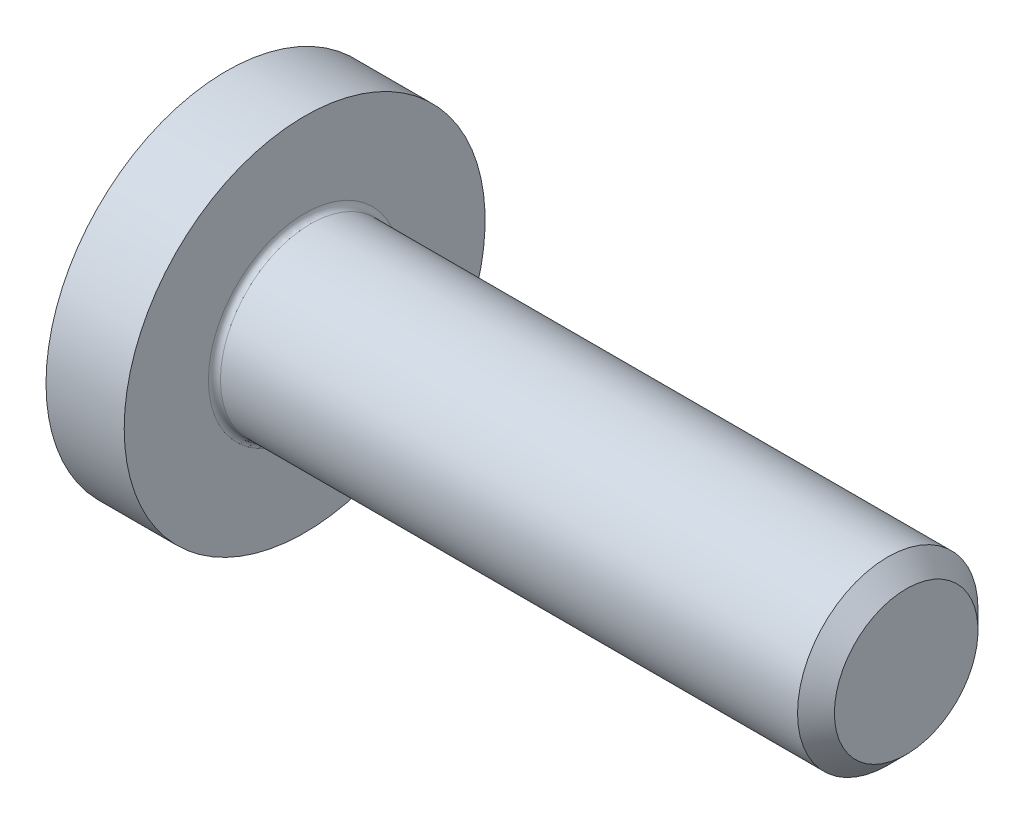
ISO-10303-21;
HEADER;
FILE_DESCRIPTION(('STEP AP214'),'2;1');
FILE_NAME('part.step','',(''),(''),'','','');
FILE_SCHEMA(('AUTOMOTIVE_DESIGN { 1 0 10303 214 1 1 1 1 }'));
ENDSEC;
DATA;
#1=APPLICATION_CONTEXT('core data for automotive mechanical design processes');
#2=APPLICATION_PROTOCOL_DEFINITION('international standard','automotive_design',2000,#1);
#3=PRODUCT_CONTEXT('',#1,'mechanical');
#4=PRODUCT('Part','Part','',(#3));
#5=PRODUCT_RELATED_PRODUCT_CATEGORY('part','',(#4));
#6=PRODUCT_DEFINITION_FORMATION('','',#4);
#7=PRODUCT_DEFINITION_CONTEXT('part definition',#1,'design');
#8=PRODUCT_DEFINITION('design','',#6,#7);
#9=PRODUCT_DEFINITION_SHAPE('','',#8);
#10=(LENGTH_UNIT() NAMED_UNIT(*) SI_UNIT(.MILLI.,.METRE.));
#11=(NAMED_UNIT(*) PLANE_ANGLE_UNIT() SI_UNIT($,.RADIAN.));
#12=(NAMED_UNIT(*) SI_UNIT($,.STERADIAN.) SOLID_ANGLE_UNIT());
#13=UNCERTAINTY_MEASURE_WITH_UNIT(LENGTH_MEASURE(1.E-05),#10,'distance_accuracy_value','');
#14=(GEOMETRIC_REPRESENTATION_CONTEXT(3) GLOBAL_UNCERTAINTY_ASSIGNED_CONTEXT((#13)) GLOBAL_UNIT_ASSIGNED_CONTEXT((#10,
#11,#12)) REPRESENTATION_CONTEXT('',''));
#15=CARTESIAN_POINT('',(0.,0.,0.));
#16=DIRECTION('',(0.,0.,1.));
#17=DIRECTION('',(1.,0.,0.));
#18=AXIS2_PLACEMENT_3D('',#15,#16,#17);
#19=CARTESIAN_POINT('',(-1.3,0.,0.));
#20=DIRECTION('',(1.,0.,0.));
#21=DIRECTION('',(0.,0.,-1.));
#22=AXIS2_PLACEMENT_3D('',#19,#20,#21);
#23=PLANE('',#22);
#24=CARTESIAN_POINT('',(-1.3,0.,0.));
#25=DIRECTION('',(-1.,0.,0.));
#26=DIRECTION('',(0.,0.,1.));
#27=AXIS2_PLACEMENT_3D('',#24,#25,#26);
#28=CIRCLE('',#27,3.);
#29=CARTESIAN_POINT('',(-1.3,0.,3.));
#30=VERTEX_POINT('',#29);
#31=EDGE_CURVE('E144',#30,#30,#28,.T.);
#32=ORIENTED_EDGE('',*,*,#31,.T.);
#33=EDGE_LOOP('',(#32));
#34=FACE_BOUND('',#33,.T.);
#35=DIRECTION('',(0.,-0.500000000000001,-0.866025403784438));
#36=VECTOR('',#35,1.);
#37=CARTESIAN_POINT('',(-1.3,-0.43301270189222,0.75));
#38=LINE('',#37,#36);
#39=CARTESIAN_POINT('',(-1.3,-0.43301270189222,0.75));
#40=VERTEX_POINT('',#39);
#41=CARTESIAN_POINT('',(-1.3,-0.86602540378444,0.));
#42=VERTEX_POINT('',#41);
#43=EDGE_CURVE('E376',#40,#42,#38,.T.);
#44=ORIENTED_EDGE('',*,*,#43,.T.);
#45=DIRECTION('',(0.,0.500000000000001,-0.866025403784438));
#46=VECTOR('',#45,1.);
#47=CARTESIAN_POINT('',(-1.3,-0.86602540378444,0.));
#48=LINE('',#47,#46);
#49=CARTESIAN_POINT('',(-1.3,-0.43301270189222,-0.75));
#50=VERTEX_POINT('',#49);
#51=EDGE_CURVE('E378',#42,#50,#48,.T.);
#52=ORIENTED_EDGE('',*,*,#51,.T.);
#53=DIRECTION('',(0.,1.,0.));
#54=VECTOR('',#53,1.);
#55=CARTESIAN_POINT('',(-1.3,-0.43301270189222,-0.75));
#56=LINE('',#55,#54);
#57=CARTESIAN_POINT('',(-1.3,0.43301270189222,-0.75));
#58=VERTEX_POINT('',#57);
#59=EDGE_CURVE('E380',#50,#58,#56,.T.);
#60=ORIENTED_EDGE('',*,*,#59,.T.);
#61=DIRECTION('',(0.,0.500000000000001,0.866025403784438));
#62=VECTOR('',#61,1.);
#63=CARTESIAN_POINT('',(-1.3,0.43301270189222,-0.75));
#64=LINE('',#63,#62);
#65=CARTESIAN_POINT('',(-1.3,0.86602540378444,0.));
#66=VERTEX_POINT('',#65);
#67=EDGE_CURVE('E119',#58,#66,#64,.T.);
#68=ORIENTED_EDGE('',*,*,#67,.T.);
#69=DIRECTION('',(0.,-0.500000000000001,0.866025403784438));
#70=VECTOR('',#69,1.);
#71=CARTESIAN_POINT('',(-1.3,0.86602540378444,0.));
#72=LINE('',#71,#70);
#73=CARTESIAN_POINT('',(-1.3,0.43301270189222,0.75));
#74=VERTEX_POINT('',#73);
#75=EDGE_CURVE('E373',#66,#74,#72,.T.);
#76=ORIENTED_EDGE('',*,*,#75,.T.);
#77=DIRECTION('',(0.,-1.,0.));
#78=VECTOR('',#77,1.);
#79=CARTESIAN_POINT('',(-1.3,0.43301270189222,0.75));
#80=LINE('',#79,#78);
#81=EDGE_CURVE('E134',#74,#40,#80,.T.);
#82=ORIENTED_EDGE('',*,*,#81,.T.);
#83=EDGE_LOOP('',(#44,#52,#60,#68,#76,#82));
#84=FACE_BOUND('',#83,.T.);
#85=ADVANCED_FACE('F35',(#34,#84),#23,.F.);
#86=CARTESIAN_POINT('',(10.,1.1935,0.));
#87=DIRECTION('',(-1.,0.,0.));
#88=DIRECTION('',(0.,0.,1.));
#89=AXIS2_PLACEMENT_3D('',#86,#87,#88);
#90=PLANE('',#89);
#91=CARTESIAN_POINT('',(10.,0.,0.));
#92=DIRECTION('',(-1.,0.,0.));
#93=DIRECTION('',(0.,0.,1.));
#94=AXIS2_PLACEMENT_3D('',#91,#92,#93);
#95=CIRCLE('',#94,1.1935);
#96=CARTESIAN_POINT('',(10.,0.,1.1935));
#97=VERTEX_POINT('',#96);
#98=EDGE_CURVE('E11',#97,#97,#95,.T.);
#99=ORIENTED_EDGE('',*,*,#98,.F.);
#100=EDGE_LOOP('',(#99));
#101=FACE_BOUND('',#100,.T.);
#102=ADVANCED_FACE('F37',(#101),#90,.F.);
#103=CARTESIAN_POINT('',(10.,0.,0.));
#104=DIRECTION('',(-1.,0.,0.));
#105=DIRECTION('',(0.,0.,1.));
#106=AXIS2_PLACEMENT_3D('',#103,#104,#105);
#107=CONICAL_SURFACE('',#106,1.1935,0.785398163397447);
#108=CARTESIAN_POINT('',(9.6935,0.,0.));
#109=DIRECTION('',(-1.,0.,0.));
#110=DIRECTION('',(0.,0.,1.));
#111=AXIS2_PLACEMENT_3D('',#108,#109,#110);
#112=CIRCLE('',#111,1.5);
#113=CARTESIAN_POINT('',(9.6935,0.,1.5));
#114=VERTEX_POINT('',#113);
#115=EDGE_CURVE('E43',#114,#114,#112,.T.);
#116=ORIENTED_EDGE('',*,*,#115,.F.);
#117=EDGE_LOOP('',(#116));
#118=FACE_BOUND('',#117,.T.);
#119=ORIENTED_EDGE('',*,*,#98,.T.);
#120=EDGE_LOOP('',(#119));
#121=FACE_BOUND('',#120,.T.);
#122=ADVANCED_FACE('F161',(#118,#121),#107,.T.);
#123=CARTESIAN_POINT('',(10.,0.,0.));
#124=DIRECTION('',(-1.,0.,0.));
#125=DIRECTION('',(0.,0.,1.));
#126=AXIS2_PLACEMENT_3D('',#123,#124,#125);
#127=CYLINDRICAL_SURFACE('',#126,1.5);
#128=CARTESIAN_POINT('',(0.0999999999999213,0.,0.));
#129=DIRECTION('',(-1.,0.,0.));
#130=DIRECTION('',(0.,0.,1.));
#131=AXIS2_PLACEMENT_3D('',#128,#129,#130);
#132=CIRCLE('',#131,1.5);
#133=CARTESIAN_POINT('',(0.0999999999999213,0.,1.5));
#134=VERTEX_POINT('',#133);
#135=EDGE_CURVE('E154',#134,#134,#132,.T.);
#136=ORIENTED_EDGE('',*,*,#135,.F.);
#137=EDGE_LOOP('',(#136));
#138=FACE_BOUND('',#137,.T.);
#139=ORIENTED_EDGE('',*,*,#115,.T.);
#140=EDGE_LOOP('',(#139));
#141=FACE_BOUND('',#140,.T.);
#142=ADVANCED_FACE('F159',(#138,#141),#127,.T.);
#143=CARTESIAN_POINT('',(0.0999999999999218,0.,0.));
#144=DIRECTION('',(-1.,0.,0.));
#145=DIRECTION('',(0.,0.,1.));
#146=AXIS2_PLACEMENT_3D('',#143,#144,#145);
#147=TOROIDAL_SURFACE('',#146,1.59999999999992,0.0999999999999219);
#148=CARTESIAN_POINT('',(0.,0.,0.));
#149=DIRECTION('',(-1.,0.,0.));
#150=DIRECTION('',(0.,0.,1.));
#151=AXIS2_PLACEMENT_3D('',#148,#149,#150);
#152=CIRCLE('',#151,1.59999999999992);
#153=CARTESIAN_POINT('',(0.,0.,1.59999999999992));
#154=VERTEX_POINT('',#153);
#155=EDGE_CURVE('E151',#154,#154,#152,.T.);
#156=ORIENTED_EDGE('',*,*,#155,.F.);
#157=EDGE_LOOP('',(#156));
#158=FACE_BOUND('',#157,.T.);
#159=ORIENTED_EDGE('',*,*,#135,.T.);
#160=EDGE_LOOP('',(#159));
#161=FACE_BOUND('',#160,.T.);
#162=ADVANCED_FACE('F186',(#158,#161),#147,.F.);
#163=CARTESIAN_POINT('',(0.,3.,0.));
#164=DIRECTION('',(-1.,0.,0.));
#165=DIRECTION('',(0.,0.,1.));
#166=AXIS2_PLACEMENT_3D('',#163,#164,#165);
#167=PLANE('',#166);
#168=CARTESIAN_POINT('',(0.,0.,0.));
#169=DIRECTION('',(-1.,0.,0.));
#170=DIRECTION('',(0.,0.,1.));
#171=AXIS2_PLACEMENT_3D('',#168,#169,#170);
#172=CIRCLE('',#171,3.);
#173=CARTESIAN_POINT('',(0.,0.,3.));
#174=VERTEX_POINT('',#173);
#175=EDGE_CURVE('E148',#174,#174,#172,.T.);
#176=ORIENTED_EDGE('',*,*,#175,.F.);
#177=EDGE_LOOP('',(#176));
#178=FACE_BOUND('',#177,.T.);
#179=ORIENTED_EDGE('',*,*,#155,.T.);
#180=EDGE_LOOP('',(#179));
#181=FACE_BOUND('',#180,.T.);
#182=ADVANCED_FACE('F182',(#178,#181),#167,.F.);
#183=CARTESIAN_POINT('',(10.,0.,0.));
#184=DIRECTION('',(-1.,0.,0.));
#185=DIRECTION('',(0.,0.,1.));
#186=AXIS2_PLACEMENT_3D('',#183,#184,#185);
#187=CYLINDRICAL_SURFACE('',#186,3.);
#188=ORIENTED_EDGE('',*,*,#31,.F.);
#189=EDGE_LOOP('',(#188));
#190=FACE_BOUND('',#189,.T.);
#191=ORIENTED_EDGE('',*,*,#175,.T.);
#192=EDGE_LOOP('',(#191));
#193=FACE_BOUND('',#192,.T.);
#194=ADVANCED_FACE('F179',(#190,#193),#187,.T.);
#195=CARTESIAN_POINT('',(0.7,0.86602540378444,0.));
#196=DIRECTION('',(0.,-0.866025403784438,-0.500000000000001));
#197=DIRECTION('',(0.,0.500000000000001,-0.866025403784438));
#198=AXIS2_PLACEMENT_3D('',#195,#196,#197);
#199=PLANE('',#198);
#200=DIRECTION('',(0.,-0.500000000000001,0.866025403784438));
#201=VECTOR('',#200,1.);
#202=CARTESIAN_POINT('',(0.7,0.86602540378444,0.));
#203=LINE('',#202,#201);
#204=CARTESIAN_POINT('',(0.7,0.86602540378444,0.));
#205=VERTEX_POINT('',#204);
#206=CARTESIAN_POINT('',(0.7,0.64951905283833,0.375000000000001));
#207=VERTEX_POINT('',#206);
#208=EDGE_CURVE('E116',#205,#207,#203,.T.);
#209=ORIENTED_EDGE('',*,*,#208,.T.);
#210=CARTESIAN_POINT('',(0.7,0.43301270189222,0.75));
#211=VERTEX_POINT('',#210);
#212=EDGE_CURVE('E108',#207,#211,#203,.T.);
#213=ORIENTED_EDGE('',*,*,#212,.T.);
#214=DIRECTION('',(-1.,0.,0.));
#215=VECTOR('',#214,1.);
#216=CARTESIAN_POINT('',(0.7,0.43301270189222,0.75));
#217=LINE('',#216,#215);
#218=EDGE_CURVE('E113',#211,#74,#217,.T.);
#219=ORIENTED_EDGE('',*,*,#218,.T.);
#220=ORIENTED_EDGE('',*,*,#75,.F.);
#221=DIRECTION('',(-1.,0.,0.));
#222=VECTOR('',#221,1.);
#223=CARTESIAN_POINT('',(0.7,0.86602540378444,0.));
#224=LINE('',#223,#222);
#225=EDGE_CURVE('E372',#205,#66,#224,.T.);
#226=ORIENTED_EDGE('',*,*,#225,.F.);
#227=EDGE_LOOP('',(#209,#213,#219,#220,#226));
#228=FACE_BOUND('',#227,.T.);
#229=ADVANCED_FACE('F110',(#228),#199,.T.);
#230=CARTESIAN_POINT('',(0.7,0.43301270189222,0.75));
#231=DIRECTION('',(0.,0.,-1.));
#232=DIRECTION('',(-1.,0.,0.));
#233=AXIS2_PLACEMENT_3D('',#230,#231,#232);
#234=PLANE('',#233);
#235=DIRECTION('',(0.,-1.,0.));
#236=VECTOR('',#235,1.);
#237=CARTESIAN_POINT('',(0.7,0.43301270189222,0.75));
#238=LINE('',#237,#236);
#239=CARTESIAN_POINT('',(0.7,0.,0.75));
#240=VERTEX_POINT('',#239);
#241=EDGE_CURVE('E122',#211,#240,#238,.T.);
#242=ORIENTED_EDGE('',*,*,#241,.T.);
#243=CARTESIAN_POINT('',(0.7,-0.43301270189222,0.75));
#244=VERTEX_POINT('',#243);
#245=EDGE_CURVE('E129',#240,#244,#238,.T.);
#246=ORIENTED_EDGE('',*,*,#245,.T.);
#247=DIRECTION('',(-1.,0.,0.));
#248=VECTOR('',#247,1.);
#249=CARTESIAN_POINT('',(0.7,-0.43301270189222,0.75));
#250=LINE('',#249,#248);
#251=EDGE_CURVE('E136',#244,#40,#250,.T.);
#252=ORIENTED_EDGE('',*,*,#251,.T.);
#253=ORIENTED_EDGE('',*,*,#81,.F.);
#254=ORIENTED_EDGE('',*,*,#218,.F.);
#255=EDGE_LOOP('',(#242,#246,#252,#253,#254));
#256=FACE_BOUND('',#255,.T.);
#257=ADVANCED_FACE('F132',(#256),#234,.T.);
#258=CARTESIAN_POINT('',(0.7,-0.43301270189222,0.75));
#259=DIRECTION('',(0.,0.866025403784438,-0.500000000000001));
#260=DIRECTION('',(0.,0.500000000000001,0.866025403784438));
#261=AXIS2_PLACEMENT_3D('',#258,#259,#260);
#262=PLANE('',#261);
#263=DIRECTION('',(0.,-0.500000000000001,-0.866025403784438));
#264=VECTOR('',#263,1.);
#265=CARTESIAN_POINT('',(0.7,-0.43301270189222,0.75));
#266=LINE('',#265,#264);
#267=CARTESIAN_POINT('',(0.7,-0.64951905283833,0.375000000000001));
#268=VERTEX_POINT('',#267);
#269=EDGE_CURVE('E356',#244,#268,#266,.T.);
#270=ORIENTED_EDGE('',*,*,#269,.T.);
#271=CARTESIAN_POINT('',(0.7,-0.86602540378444,0.));
#272=VERTEX_POINT('',#271);
#273=EDGE_CURVE('E128',#268,#272,#266,.T.);
#274=ORIENTED_EDGE('',*,*,#273,.T.);
#275=DIRECTION('',(-1.,0.,0.));
#276=VECTOR('',#275,1.);
#277=CARTESIAN_POINT('',(0.7,-0.86602540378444,0.));
#278=LINE('',#277,#276);
#279=EDGE_CURVE('E140',#272,#42,#278,.T.);
#280=ORIENTED_EDGE('',*,*,#279,.T.);
#281=ORIENTED_EDGE('',*,*,#43,.F.);
#282=ORIENTED_EDGE('',*,*,#251,.F.);
#283=EDGE_LOOP('',(#270,#274,#280,#281,#282));
#284=FACE_BOUND('',#283,.T.);
#285=ADVANCED_FACE('F222',(#284),#262,.T.);
#286=CARTESIAN_POINT('',(0.7,-0.86602540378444,0.));
#287=DIRECTION('',(0.,0.866025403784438,0.500000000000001));
#288=DIRECTION('',(0.,-0.500000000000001,0.866025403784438));
#289=AXIS2_PLACEMENT_3D('',#286,#287,#288);
#290=PLANE('',#289);
#291=DIRECTION('',(0.,0.500000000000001,-0.866025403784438));
#292=VECTOR('',#291,1.);
#293=CARTESIAN_POINT('',(0.7,-0.86602540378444,0.));
#294=LINE('',#293,#292);
#295=CARTESIAN_POINT('',(0.7,-0.649519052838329,-0.375));
#296=VERTEX_POINT('',#295);
#297=EDGE_CURVE('E50',#272,#296,#294,.T.);
#298=ORIENTED_EDGE('',*,*,#297,.T.);
#299=CARTESIAN_POINT('',(0.7,-0.43301270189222,-0.75));
#300=VERTEX_POINT('',#299);
#301=EDGE_CURVE('E361',#296,#300,#294,.T.);
#302=ORIENTED_EDGE('',*,*,#301,.T.);
#303=DIRECTION('',(-1.,0.,0.));
#304=VECTOR('',#303,1.);
#305=CARTESIAN_POINT('',(0.7,-0.43301270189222,-0.75));
#306=LINE('',#305,#304);
#307=EDGE_CURVE('E388',#300,#50,#306,.T.);
#308=ORIENTED_EDGE('',*,*,#307,.T.);
#309=ORIENTED_EDGE('',*,*,#51,.F.);
#310=ORIENTED_EDGE('',*,*,#279,.F.);
#311=EDGE_LOOP('',(#298,#302,#308,#309,#310));
#312=FACE_BOUND('',#311,.T.);
#313=ADVANCED_FACE('F229',(#312),#290,.T.);
#314=CARTESIAN_POINT('',(0.7,-0.43301270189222,-0.75));
#315=DIRECTION('',(0.,0.,1.));
#316=DIRECTION('',(1.,0.,0.));
#317=AXIS2_PLACEMENT_3D('',#314,#315,#316);
#318=PLANE('',#317);
#319=DIRECTION('',(0.,1.,0.));
#320=VECTOR('',#319,1.);
#321=CARTESIAN_POINT('',(0.7,-0.43301270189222,-0.75));
#322=LINE('',#321,#320);
#323=CARTESIAN_POINT('',(0.7,0.,-0.75));
#324=VERTEX_POINT('',#323);
#325=EDGE_CURVE('E365',#300,#324,#322,.T.);
#326=ORIENTED_EDGE('',*,*,#325,.T.);
#327=CARTESIAN_POINT('',(0.7,0.43301270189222,-0.75));
#328=VERTEX_POINT('',#327);
#329=EDGE_CURVE('E364',#324,#328,#322,.T.);
#330=ORIENTED_EDGE('',*,*,#329,.T.);
#331=DIRECTION('',(-1.,0.,0.));
#332=VECTOR('',#331,1.);
#333=CARTESIAN_POINT('',(0.7,0.43301270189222,-0.75));
#334=LINE('',#333,#332);
#335=EDGE_CURVE('E385',#328,#58,#334,.T.);
#336=ORIENTED_EDGE('',*,*,#335,.T.);
#337=ORIENTED_EDGE('',*,*,#59,.F.);
#338=ORIENTED_EDGE('',*,*,#307,.F.);
#339=EDGE_LOOP('',(#326,#330,#336,#337,#338));
#340=FACE_BOUND('',#339,.T.);
#341=ADVANCED_FACE('F237',(#340),#318,.T.);
#342=CARTESIAN_POINT('',(0.7,0.43301270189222,-0.75));
#343=DIRECTION('',(0.,-0.866025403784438,0.500000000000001));
#344=DIRECTION('',(0.,-0.500000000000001,-0.866025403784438));
#345=AXIS2_PLACEMENT_3D('',#342,#343,#344);
#346=PLANE('',#345);
#347=DIRECTION('',(0.,0.500000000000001,0.866025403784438));
#348=VECTOR('',#347,1.);
#349=CARTESIAN_POINT('',(0.7,0.43301270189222,-0.75));
#350=LINE('',#349,#348);
#351=CARTESIAN_POINT('',(0.7,0.64951905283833,-0.375000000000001));
#352=VERTEX_POINT('',#351);
#353=EDGE_CURVE('E369',#328,#352,#350,.T.);
#354=ORIENTED_EDGE('',*,*,#353,.T.);
#355=EDGE_CURVE('E368',#352,#205,#350,.T.);
#356=ORIENTED_EDGE('',*,*,#355,.T.);
#357=ORIENTED_EDGE('',*,*,#225,.T.);
#358=ORIENTED_EDGE('',*,*,#67,.F.);
#359=ORIENTED_EDGE('',*,*,#335,.F.);
#360=EDGE_LOOP('',(#354,#356,#357,#358,#359));
#361=FACE_BOUND('',#360,.T.);
#362=ADVANCED_FACE('F244',(#361),#346,.T.);
#363=CARTESIAN_POINT('',(0.7,0.43301270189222,0.75));
#364=DIRECTION('',(1.,0.,0.));
#365=DIRECTION('',(0.,0.,-1.));
#366=AXIS2_PLACEMENT_3D('',#363,#364,#365);
#367=PLANE('',#366);
#368=CARTESIAN_POINT('',(0.7,0.,0.));
#369=DIRECTION('',(-1.,0.,0.));
#370=DIRECTION('',(0.,0.,1.));
#371=AXIS2_PLACEMENT_3D('',#368,#369,#370);
#372=CIRCLE('',#371,0.75);
#373=EDGE_CURVE('E395',#352,#324,#372,.T.);
#374=ORIENTED_EDGE('',*,*,#373,.F.);
#375=ORIENTED_EDGE('',*,*,#353,.F.);
#376=ORIENTED_EDGE('',*,*,#329,.F.);
#377=EDGE_LOOP('',(#374,#375,#376));
#378=FACE_BOUND('',#377,.T.);
#379=ADVANCED_FACE('F252',(#378),#367,.F.);
#380=EDGE_CURVE('E145',#207,#352,#372,.T.);
#381=ORIENTED_EDGE('',*,*,#380,.F.);
#382=ORIENTED_EDGE('',*,*,#208,.F.);
#383=ORIENTED_EDGE('',*,*,#355,.F.);
#384=EDGE_LOOP('',(#381,#382,#383));
#385=FACE_BOUND('',#384,.T.);
#386=ADVANCED_FACE('F260',(#385),#367,.F.);
#387=EDGE_CURVE('E124',#240,#207,#372,.T.);
#388=ORIENTED_EDGE('',*,*,#387,.F.);
#389=ORIENTED_EDGE('',*,*,#241,.F.);
#390=ORIENTED_EDGE('',*,*,#212,.F.);
#391=EDGE_LOOP('',(#388,#389,#390));
#392=FACE_BOUND('',#391,.T.);
#393=ADVANCED_FACE('F123',(#392),#367,.F.);
#394=EDGE_CURVE('E135',#268,#240,#372,.T.);
#395=ORIENTED_EDGE('',*,*,#394,.F.);
#396=ORIENTED_EDGE('',*,*,#269,.F.);
#397=ORIENTED_EDGE('',*,*,#245,.F.);
#398=EDGE_LOOP('',(#395,#396,#397));
#399=FACE_BOUND('',#398,.T.);
#400=ADVANCED_FACE('F275',(#399),#367,.F.);
#401=EDGE_CURVE('E138',#296,#268,#372,.T.);
#402=ORIENTED_EDGE('',*,*,#401,.F.);
#403=ORIENTED_EDGE('',*,*,#297,.F.);
#404=ORIENTED_EDGE('',*,*,#273,.F.);
#405=EDGE_LOOP('',(#402,#403,#404));
#406=FACE_BOUND('',#405,.T.);
#407=ADVANCED_FACE('F281',(#406),#367,.F.);
#408=EDGE_CURVE('E396',#324,#296,#372,.T.);
#409=ORIENTED_EDGE('',*,*,#408,.F.);
#410=ORIENTED_EDGE('',*,*,#325,.F.);
#411=ORIENTED_EDGE('',*,*,#301,.F.);
#412=EDGE_LOOP('',(#409,#410,#411));
#413=FACE_BOUND('',#412,.T.);
#414=ADVANCED_FACE('F263',(#413),#367,.F.);
#415=CARTESIAN_POINT('',(1.1330127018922,0.,0.));
#416=DIRECTION('',(-1.,0.,0.));
#417=DIRECTION('',(0.,0.,1.));
#418=AXIS2_PLACEMENT_3D('',#415,#416,#417);
#419=CONICAL_SURFACE('',#418,0.,1.04719755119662);
#420=ORIENTED_EDGE('',*,*,#387,.T.);
#421=ORIENTED_EDGE('',*,*,#380,.T.);
#422=ORIENTED_EDGE('',*,*,#373,.T.);
#423=ORIENTED_EDGE('',*,*,#408,.T.);
#424=ORIENTED_EDGE('',*,*,#401,.T.);
#425=ORIENTED_EDGE('',*,*,#394,.T.);
#426=EDGE_LOOP('',(#420,#421,#422,#423,#424,#425));
#427=FACE_BOUND('',#426,.T.);
#428=CARTESIAN_POINT('',(1.1330127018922,0.,0.));
#429=VERTEX_POINT('',#428);
#430=VERTEX_LOOP('',#429);
#431=FACE_BOUND('',#430,.T.);
#432=ADVANCED_FACE('F177',(#427,#431),#419,.F.);
#433=CLOSED_SHELL('',(#85,#102,#122,#142,#162,#182,#194,#229,#257,#285,#313,#341,#362,#379,#386,
#393,#400,#407,#414,#432));
#434=MANIFOLD_SOLID_BREP('B2',#433);
#435=ADVANCED_BREP_SHAPE_REPRESENTATION('',(#18,#434),#14);
#436=SHAPE_DEFINITION_REPRESENTATION(#9,#435);
ENDSEC;
END-ISO-10303-21;
